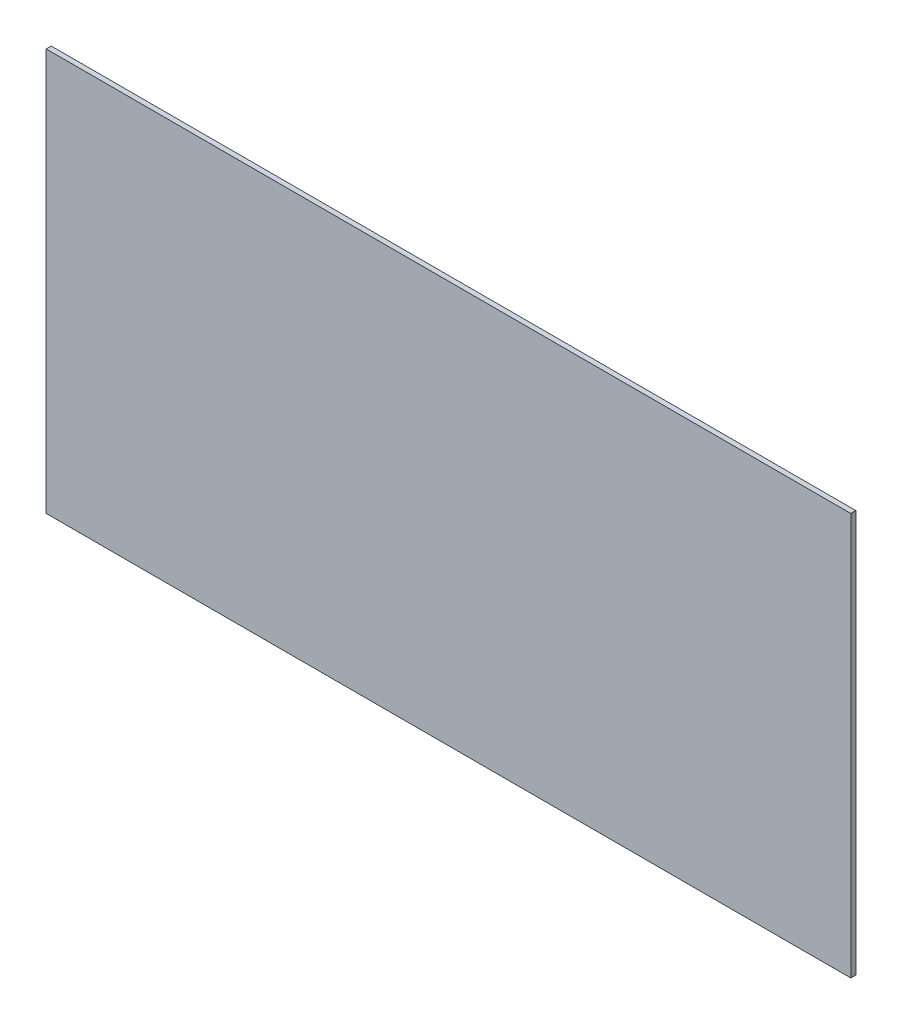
ISO-10303-21;
HEADER;
FILE_DESCRIPTION(('STEP AP214'),'2;1');
FILE_NAME('part.step','',(''),(''),'','','');
FILE_SCHEMA(('AUTOMOTIVE_DESIGN { 1 0 10303 214 1 1 1 1 }'));
ENDSEC;
DATA;
#1=APPLICATION_CONTEXT('core data for automotive mechanical design processes');
#2=APPLICATION_PROTOCOL_DEFINITION('international standard','automotive_design',2000,#1);
#3=PRODUCT_CONTEXT('',#1,'mechanical');
#4=PRODUCT('Part','Part','',(#3));
#5=PRODUCT_RELATED_PRODUCT_CATEGORY('part','',(#4));
#6=PRODUCT_DEFINITION_FORMATION('','',#4);
#7=PRODUCT_DEFINITION_CONTEXT('part definition',#1,'design');
#8=PRODUCT_DEFINITION('design','',#6,#7);
#9=PRODUCT_DEFINITION_SHAPE('','',#8);
#10=(LENGTH_UNIT() NAMED_UNIT(*) SI_UNIT(.MILLI.,.METRE.));
#11=(NAMED_UNIT(*) PLANE_ANGLE_UNIT() SI_UNIT($,.RADIAN.));
#12=(NAMED_UNIT(*) SI_UNIT($,.STERADIAN.) SOLID_ANGLE_UNIT());
#13=UNCERTAINTY_MEASURE_WITH_UNIT(LENGTH_MEASURE(1.E-05),#10,'distance_accuracy_value','');
#14=(GEOMETRIC_REPRESENTATION_CONTEXT(3) GLOBAL_UNCERTAINTY_ASSIGNED_CONTEXT((#13)) GLOBAL_UNIT_ASSIGNED_CONTEXT((#10,
#11,#12)) REPRESENTATION_CONTEXT('',''));
#15=CARTESIAN_POINT('',(0.,0.,0.));
#16=DIRECTION('',(0.,0.,1.));
#17=DIRECTION('',(1.,0.,0.));
#18=AXIS2_PLACEMENT_3D('',#15,#16,#17);
#19=CARTESIAN_POINT('',(-798.76759628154,460.100929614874,12.7));
#20=DIRECTION('',(1.,0.,0.));
#21=DIRECTION('',(0.,1.,0.));
#22=AXIS2_PLACEMENT_3D('',#19,#20,#21);
#23=PLANE('',#22);
#24=DIRECTION('',(0.,-1.,0.));
#25=VECTOR('',#24,1.);
#26=CARTESIAN_POINT('',(-798.76759628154,460.100929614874,0.));
#27=LINE('',#26,#25);
#28=CARTESIAN_POINT('',(-798.76759628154,460.100929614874,0.));
#29=VERTEX_POINT('',#28);
#30=CARTESIAN_POINT('',(-798.76759628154,-555.899070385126,0.));
#31=VERTEX_POINT('',#30);
#32=EDGE_CURVE('E96',#29,#31,#27,.T.);
#33=ORIENTED_EDGE('',*,*,#32,.T.);
#34=DIRECTION('',(0.,0.,-1.));
#35=VECTOR('',#34,1.);
#36=CARTESIAN_POINT('',(-798.76759628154,-555.899070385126,12.7));
#37=LINE('',#36,#35);
#38=CARTESIAN_POINT('',(-798.76759628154,-555.899070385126,12.7));
#39=VERTEX_POINT('',#38);
#40=EDGE_CURVE('E11',#39,#31,#37,.T.);
#41=ORIENTED_EDGE('',*,*,#40,.F.);
#42=DIRECTION('',(0.,-1.,0.));
#43=VECTOR('',#42,1.);
#44=CARTESIAN_POINT('',(-798.76759628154,460.100929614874,12.7));
#45=LINE('',#44,#43);
#46=CARTESIAN_POINT('',(-798.76759628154,460.100929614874,12.7));
#47=VERTEX_POINT('',#46);
#48=EDGE_CURVE('E84',#47,#39,#45,.T.);
#49=ORIENTED_EDGE('',*,*,#48,.F.);
#50=DIRECTION('',(0.,0.,-1.));
#51=VECTOR('',#50,1.);
#52=CARTESIAN_POINT('',(-798.76759628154,460.100929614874,12.7));
#53=LINE('',#52,#51);
#54=EDGE_CURVE('E92',#47,#29,#53,.T.);
#55=ORIENTED_EDGE('',*,*,#54,.T.);
#56=EDGE_LOOP('',(#33,#41,#49,#55));
#57=FACE_BOUND('',#56,.T.);
#58=ADVANCED_FACE('F33',(#57),#23,.F.);
#59=CARTESIAN_POINT('',(-798.76759628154,-555.899070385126,12.7));
#60=DIRECTION('',(0.,1.,0.));
#61=DIRECTION('',(0.,0.,1.));
#62=AXIS2_PLACEMENT_3D('',#59,#60,#61);
#63=PLANE('',#62);
#64=DIRECTION('',(1.,0.,0.));
#65=VECTOR('',#64,1.);
#66=CARTESIAN_POINT('',(-798.76759628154,-555.899070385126,0.));
#67=LINE('',#66,#65);
#68=CARTESIAN_POINT('',(1233.23240371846,-555.899070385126,0.));
#69=VERTEX_POINT('',#68);
#70=EDGE_CURVE('E88',#31,#69,#67,.T.);
#71=ORIENTED_EDGE('',*,*,#70,.T.);
#72=DIRECTION('',(0.,0.,-1.));
#73=VECTOR('',#72,1.);
#74=CARTESIAN_POINT('',(1233.23240371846,-555.899070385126,12.7));
#75=LINE('',#74,#73);
#76=CARTESIAN_POINT('',(1233.23240371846,-555.899070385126,12.7));
#77=VERTEX_POINT('',#76);
#78=EDGE_CURVE('E41',#77,#69,#75,.T.);
#79=ORIENTED_EDGE('',*,*,#78,.F.);
#80=DIRECTION('',(1.,0.,0.));
#81=VECTOR('',#80,1.);
#82=CARTESIAN_POINT('',(-798.76759628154,-555.899070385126,12.7));
#83=LINE('',#82,#81);
#84=EDGE_CURVE('E79',#39,#77,#83,.T.);
#85=ORIENTED_EDGE('',*,*,#84,.F.);
#86=ORIENTED_EDGE('',*,*,#40,.T.);
#87=EDGE_LOOP('',(#71,#79,#85,#86));
#88=FACE_BOUND('',#87,.T.);
#89=ADVANCED_FACE('F87',(#88),#63,.F.);
#90=CARTESIAN_POINT('',(1233.23240371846,460.100929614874,12.7));
#91=DIRECTION('',(-1.,0.,0.));
#92=DIRECTION('',(0.,-1.,0.));
#93=AXIS2_PLACEMENT_3D('',#90,#91,#92);
#94=PLANE('',#93);
#95=DIRECTION('',(0.,1.,0.));
#96=VECTOR('',#95,1.);
#97=CARTESIAN_POINT('',(1233.23240371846,460.100929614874,0.));
#98=LINE('',#97,#96);
#99=CARTESIAN_POINT('',(1233.23240371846,460.100929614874,0.));
#100=VERTEX_POINT('',#99);
#101=EDGE_CURVE('E66',#69,#100,#98,.T.);
#102=ORIENTED_EDGE('',*,*,#101,.T.);
#103=DIRECTION('',(0.,0.,-1.));
#104=VECTOR('',#103,1.);
#105=CARTESIAN_POINT('',(1233.23240371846,460.100929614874,12.7));
#106=LINE('',#105,#104);
#107=CARTESIAN_POINT('',(1233.23240371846,460.100929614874,12.7));
#108=VERTEX_POINT('',#107);
#109=EDGE_CURVE('E89',#108,#100,#106,.T.);
#110=ORIENTED_EDGE('',*,*,#109,.F.);
#111=DIRECTION('',(0.,1.,0.));
#112=VECTOR('',#111,1.);
#113=CARTESIAN_POINT('',(1233.23240371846,460.100929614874,12.7));
#114=LINE('',#113,#112);
#115=EDGE_CURVE('E82',#77,#108,#114,.T.);
#116=ORIENTED_EDGE('',*,*,#115,.F.);
#117=ORIENTED_EDGE('',*,*,#78,.T.);
#118=EDGE_LOOP('',(#102,#110,#116,#117));
#119=FACE_BOUND('',#118,.T.);
#120=ADVANCED_FACE('F90',(#119),#94,.F.);
#121=CARTESIAN_POINT('',(-798.76759628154,460.100929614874,12.7));
#122=DIRECTION('',(0.,-1.,0.));
#123=DIRECTION('',(0.,0.,-1.));
#124=AXIS2_PLACEMENT_3D('',#121,#122,#123);
#125=PLANE('',#124);
#126=DIRECTION('',(-1.,0.,0.));
#127=VECTOR('',#126,1.);
#128=CARTESIAN_POINT('',(-798.76759628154,460.100929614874,0.));
#129=LINE('',#128,#127);
#130=EDGE_CURVE('E72',#100,#29,#129,.T.);
#131=ORIENTED_EDGE('',*,*,#130,.T.);
#132=ORIENTED_EDGE('',*,*,#54,.F.);
#133=DIRECTION('',(-1.,0.,0.));
#134=VECTOR('',#133,1.);
#135=CARTESIAN_POINT('',(-798.76759628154,460.100929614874,12.7));
#136=LINE('',#135,#134);
#137=EDGE_CURVE('E49',#108,#47,#136,.T.);
#138=ORIENTED_EDGE('',*,*,#137,.F.);
#139=ORIENTED_EDGE('',*,*,#109,.T.);
#140=EDGE_LOOP('',(#131,#132,#138,#139));
#141=FACE_BOUND('',#140,.T.);
#142=ADVANCED_FACE('F103',(#141),#125,.F.);
#143=CARTESIAN_POINT('',(0.,0.,12.7));
#144=DIRECTION('',(0.,0.,1.));
#145=DIRECTION('',(1.,0.,0.));
#146=AXIS2_PLACEMENT_3D('',#143,#144,#145);
#147=PLANE('',#146);
#148=ORIENTED_EDGE('',*,*,#48,.T.);
#149=ORIENTED_EDGE('',*,*,#84,.T.);
#150=ORIENTED_EDGE('',*,*,#115,.T.);
#151=ORIENTED_EDGE('',*,*,#137,.T.);
#152=EDGE_LOOP('',(#148,#149,#150,#151));
#153=FACE_BOUND('',#152,.T.);
#154=ADVANCED_FACE('F80',(#153),#147,.T.);
#155=CARTESIAN_POINT('',(0.,0.,0.));
#156=DIRECTION('',(0.,0.,1.));
#157=DIRECTION('',(1.,0.,0.));
#158=AXIS2_PLACEMENT_3D('',#155,#156,#157);
#159=PLANE('',#158);
#160=ORIENTED_EDGE('',*,*,#32,.F.);
#161=ORIENTED_EDGE('',*,*,#130,.F.);
#162=ORIENTED_EDGE('',*,*,#101,.F.);
#163=ORIENTED_EDGE('',*,*,#70,.F.);
#164=EDGE_LOOP('',(#160,#161,#162,#163));
#165=FACE_BOUND('',#164,.T.);
#166=ADVANCED_FACE('F106',(#165),#159,.F.);
#167=CLOSED_SHELL('',(#58,#89,#120,#142,#154,#166));
#168=MANIFOLD_SOLID_BREP('B2',#167);
#169=ADVANCED_BREP_SHAPE_REPRESENTATION('',(#18,#168),#14);
#170=SHAPE_DEFINITION_REPRESENTATION(#9,#169);
ENDSEC;
END-ISO-10303-21;
